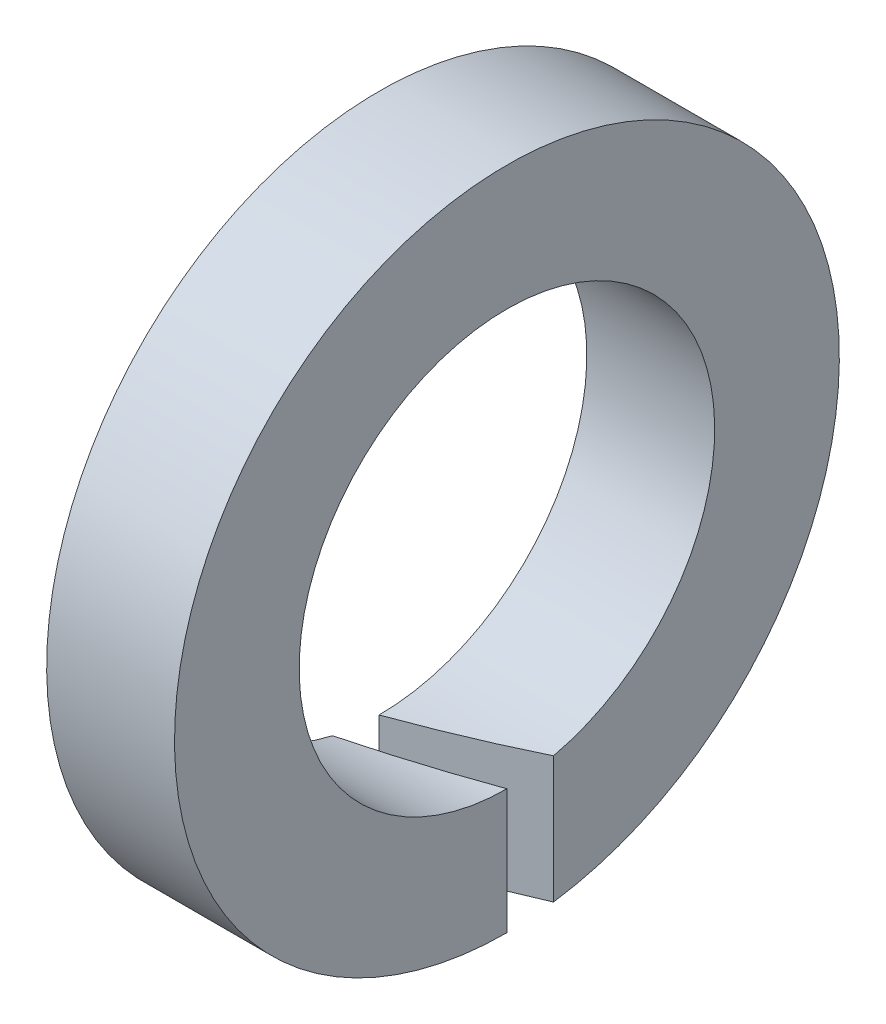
from build123d import *

# Parameters (mm, degrees)
ESQUISSE1_W             = 2
ESQUISSE1_H             = 1.95
ENL_V_MAT_EXTRU_1_DEPTH = 10


with BuildPart() as part:
    # Esquisse1 → Base-R_volution (revolve)
    with BuildSketch(Plane(origin=(0, 0, 0), x_dir=(1, 0, 0), z_dir=(0, 1, 0)), mode=Mode.PRIVATE) as base_r_volution_sk:
        with Locations((1, 4.225)):
            Rectangle(ESQUISSE1_W, ESQUISSE1_H)
    revolve(base_r_volution_sk.sketch.rotate(Axis((0, 0, 0), (1, 0, 0)), 180), axis=Axis((0, 0, 0), (1, 0, 0)))

    # Esquisse2 → Enl_v. mat.-Extru.1 (cut)
    with BuildSketch(Plane(origin=(0, 0, 0), x_dir=(1, 0, 0), z_dir=(0, 1, 0))):
        Polygon((0, 0), (2, 0.727940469), (2, 0), (0, -0.727940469), align=None)
    extrude(amount=-ENL_V_MAT_EXTRU_1_DEPTH, mode=Mode.SUBTRACT)


solid = part.part
